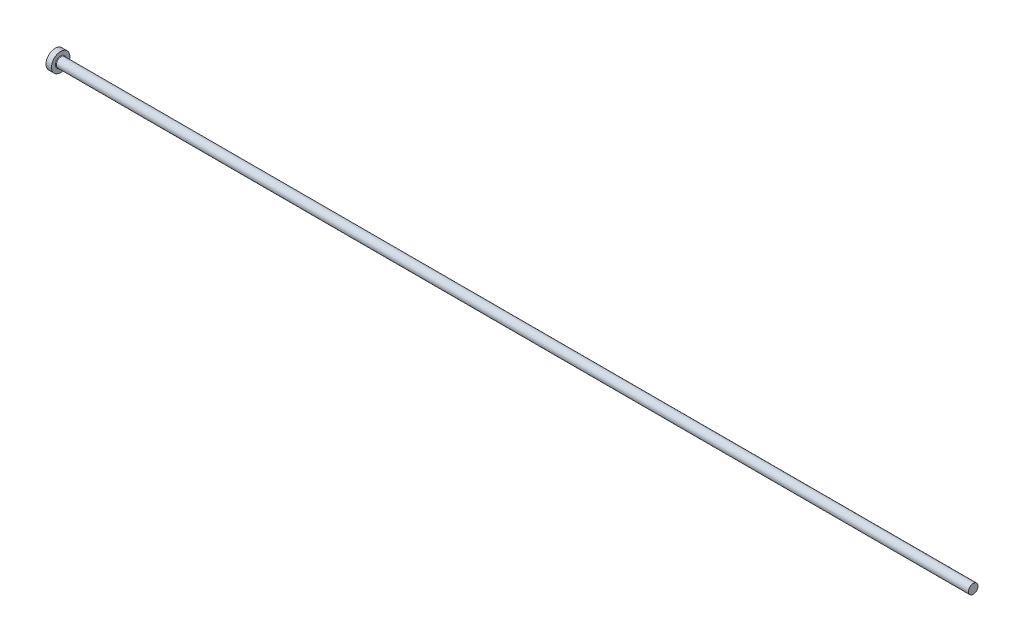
ISO-10303-21;
HEADER;
FILE_DESCRIPTION(('STEP AP214'),'2;1');
FILE_NAME('part.step','',(''),(''),'','','');
FILE_SCHEMA(('AUTOMOTIVE_DESIGN { 1 0 10303 214 1 1 1 1 }'));
ENDSEC;
DATA;
#1=APPLICATION_CONTEXT('core data for automotive mechanical design processes');
#2=APPLICATION_PROTOCOL_DEFINITION('international standard','automotive_design',2000,#1);
#3=PRODUCT_CONTEXT('',#1,'mechanical');
#4=PRODUCT('Part','Part','',(#3));
#5=PRODUCT_RELATED_PRODUCT_CATEGORY('part','',(#4));
#6=PRODUCT_DEFINITION_FORMATION('','',#4);
#7=PRODUCT_DEFINITION_CONTEXT('part definition',#1,'design');
#8=PRODUCT_DEFINITION('design','',#6,#7);
#9=PRODUCT_DEFINITION_SHAPE('','',#8);
#10=(LENGTH_UNIT() NAMED_UNIT(*) SI_UNIT(.MILLI.,.METRE.));
#11=(NAMED_UNIT(*) PLANE_ANGLE_UNIT() SI_UNIT($,.RADIAN.));
#12=(NAMED_UNIT(*) SI_UNIT($,.STERADIAN.) SOLID_ANGLE_UNIT());
#13=UNCERTAINTY_MEASURE_WITH_UNIT(LENGTH_MEASURE(1.E-05),#10,'distance_accuracy_value','');
#14=(GEOMETRIC_REPRESENTATION_CONTEXT(3) GLOBAL_UNCERTAINTY_ASSIGNED_CONTEXT((#13)) GLOBAL_UNIT_ASSIGNED_CONTEXT((#10,
#11,#12)) REPRESENTATION_CONTEXT('',''));
#15=CARTESIAN_POINT('',(0.,0.,0.));
#16=DIRECTION('',(0.,0.,1.));
#17=DIRECTION('',(1.,0.,0.));
#18=AXIS2_PLACEMENT_3D('',#15,#16,#17);
#19=CARTESIAN_POINT('',(0.,0.,0.));
#20=DIRECTION('',(-1.,0.,0.));
#21=DIRECTION('',(0.,-1.,0.));
#22=AXIS2_PLACEMENT_3D('',#19,#20,#21);
#23=PLANE('',#22);
#24=CARTESIAN_POINT('',(0.,0.,0.));
#25=DIRECTION('',(1.,0.,0.));
#26=DIRECTION('',(0.,1.,0.));
#27=AXIS2_PLACEMENT_3D('',#24,#25,#26);
#28=CIRCLE('',#27,5.);
#29=CARTESIAN_POINT('',(0.,5.,0.));
#30=VERTEX_POINT('',#29);
#31=EDGE_CURVE('E25',#30,#30,#28,.T.);
#32=ORIENTED_EDGE('',*,*,#31,.F.);
#33=EDGE_LOOP('',(#32));
#34=FACE_BOUND('',#33,.T.);
#35=ADVANCED_FACE('F14',(#34),#23,.T.);
#36=CARTESIAN_POINT('',(500.,0.,0.));
#37=DIRECTION('',(1.,0.,0.));
#38=DIRECTION('',(0.,1.,0.));
#39=AXIS2_PLACEMENT_3D('',#36,#37,#38);
#40=CYLINDRICAL_SURFACE('',#39,5.);
#41=ORIENTED_EDGE('',*,*,#31,.T.);
#42=EDGE_LOOP('',(#41));
#43=FACE_BOUND('',#42,.T.);
#44=CARTESIAN_POINT('',(3.,0.,0.));
#45=DIRECTION('',(1.,0.,0.));
#46=DIRECTION('',(0.,1.,0.));
#47=AXIS2_PLACEMENT_3D('',#44,#45,#46);
#48=CIRCLE('',#47,5.);
#49=CARTESIAN_POINT('',(3.,5.,0.));
#50=VERTEX_POINT('',#49);
#51=EDGE_CURVE('E29',#50,#50,#48,.T.);
#52=ORIENTED_EDGE('',*,*,#51,.F.);
#53=EDGE_LOOP('',(#52));
#54=FACE_BOUND('',#53,.T.);
#55=ADVANCED_FACE('F51',(#43,#54),#40,.T.);
#56=CARTESIAN_POINT('',(3.,5.,0.));
#57=DIRECTION('',(1.,0.,0.));
#58=DIRECTION('',(0.,1.,0.));
#59=AXIS2_PLACEMENT_3D('',#56,#57,#58);
#60=PLANE('',#59);
#61=CARTESIAN_POINT('',(3.,0.,0.));
#62=DIRECTION('',(1.,0.,0.));
#63=DIRECTION('',(0.,1.,0.));
#64=AXIS2_PLACEMENT_3D('',#61,#62,#63);
#65=CIRCLE('',#64,2.89999999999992);
#66=CARTESIAN_POINT('',(3.,2.89999999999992,0.));
#67=VERTEX_POINT('',#66);
#68=EDGE_CURVE('E9',#67,#67,#65,.F.);
#69=ORIENTED_EDGE('',*,*,#68,.T.);
#70=EDGE_LOOP('',(#69));
#71=FACE_BOUND('',#70,.T.);
#72=ORIENTED_EDGE('',*,*,#51,.T.);
#73=EDGE_LOOP('',(#72));
#74=FACE_BOUND('',#73,.T.);
#75=ADVANCED_FACE('F42',(#71,#74),#60,.T.);
#76=CARTESIAN_POINT('',(500.,0.,0.));
#77=DIRECTION('',(1.,0.,0.));
#78=DIRECTION('',(0.,1.,0.));
#79=AXIS2_PLACEMENT_3D('',#76,#77,#78);
#80=CYLINDRICAL_SURFACE('',#79,2.59999999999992);
#81=CARTESIAN_POINT('',(3.3,0.,0.));
#82=DIRECTION('',(1.,0.,0.));
#83=DIRECTION('',(0.,1.,0.));
#84=AXIS2_PLACEMENT_3D('',#81,#82,#83);
#85=CIRCLE('',#84,2.59999999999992);
#86=CARTESIAN_POINT('',(3.3,2.59999999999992,0.));
#87=VERTEX_POINT('',#86);
#88=EDGE_CURVE('E21',#87,#87,#85,.T.);
#89=ORIENTED_EDGE('',*,*,#88,.T.);
#90=EDGE_LOOP('',(#89));
#91=FACE_BOUND('',#90,.T.);
#92=CARTESIAN_POINT('',(500.,0.,0.));
#93=DIRECTION('',(1.,0.,0.));
#94=DIRECTION('',(0.,1.,0.));
#95=AXIS2_PLACEMENT_3D('',#92,#93,#94);
#96=CIRCLE('',#95,2.59999999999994);
#97=CARTESIAN_POINT('',(500.,2.59999999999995,0.));
#98=VERTEX_POINT('',#97);
#99=EDGE_CURVE('E34',#98,#98,#96,.T.);
#100=ORIENTED_EDGE('',*,*,#99,.F.);
#101=EDGE_LOOP('',(#100));
#102=FACE_BOUND('',#101,.T.);
#103=ADVANCED_FACE('F40',(#91,#102),#80,.T.);
#104=CARTESIAN_POINT('',(500.,2.59999999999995,0.));
#105=DIRECTION('',(1.,0.,0.));
#106=DIRECTION('',(0.,1.,0.));
#107=AXIS2_PLACEMENT_3D('',#104,#105,#106);
#108=PLANE('',#107);
#109=ORIENTED_EDGE('',*,*,#99,.T.);
#110=EDGE_LOOP('',(#109));
#111=FACE_BOUND('',#110,.T.);
#112=ADVANCED_FACE('F38',(#111),#108,.T.);
#113=CARTESIAN_POINT('',(3.3,0.,0.));
#114=DIRECTION('',(1.,0.,0.));
#115=DIRECTION('',(0.,1.,0.));
#116=AXIS2_PLACEMENT_3D('',#113,#114,#115);
#117=TOROIDAL_SURFACE('',#116,2.89999999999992,0.3);
#118=ORIENTED_EDGE('',*,*,#68,.F.);
#119=EDGE_LOOP('',(#118));
#120=FACE_BOUND('',#119,.T.);
#121=ORIENTED_EDGE('',*,*,#88,.F.);
#122=EDGE_LOOP('',(#121));
#123=FACE_BOUND('',#122,.T.);
#124=ADVANCED_FACE('F16',(#120,#123),#117,.F.);
#125=CLOSED_SHELL('',(#35,#55,#75,#103,#112,#124));
#126=MANIFOLD_SOLID_BREP('B1',#125);
#127=ADVANCED_BREP_SHAPE_REPRESENTATION('',(#18,#126),#14);
#128=SHAPE_DEFINITION_REPRESENTATION(#9,#127);
ENDSEC;
END-ISO-10303-21;
